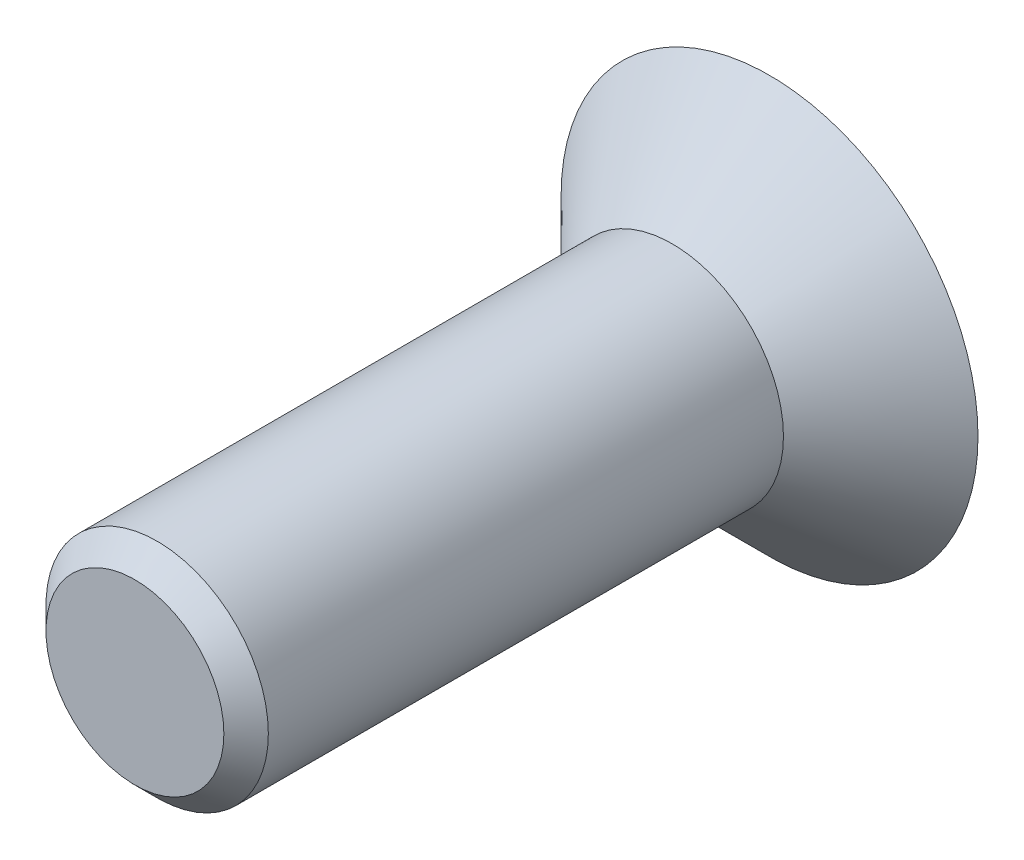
ISO-10303-21;
HEADER;
FILE_DESCRIPTION(('STEP AP214'),'2;1');
FILE_NAME('part.step','',(''),(''),'','','');
FILE_SCHEMA(('AUTOMOTIVE_DESIGN { 1 0 10303 214 1 1 1 1 }'));
ENDSEC;
DATA;
#1=APPLICATION_CONTEXT('core data for automotive mechanical design processes');
#2=APPLICATION_PROTOCOL_DEFINITION('international standard','automotive_design',2000,#1);
#3=PRODUCT_CONTEXT('',#1,'mechanical');
#4=PRODUCT('Part','Part','',(#3));
#5=PRODUCT_RELATED_PRODUCT_CATEGORY('part','',(#4));
#6=PRODUCT_DEFINITION_FORMATION('','',#4);
#7=PRODUCT_DEFINITION_CONTEXT('part definition',#1,'design');
#8=PRODUCT_DEFINITION('design','',#6,#7);
#9=PRODUCT_DEFINITION_SHAPE('','',#8);
#10=(LENGTH_UNIT() NAMED_UNIT(*) SI_UNIT(.MILLI.,.METRE.));
#11=(NAMED_UNIT(*) PLANE_ANGLE_UNIT() SI_UNIT($,.RADIAN.));
#12=(NAMED_UNIT(*) SI_UNIT($,.STERADIAN.) SOLID_ANGLE_UNIT());
#13=UNCERTAINTY_MEASURE_WITH_UNIT(LENGTH_MEASURE(1.E-05),#10,'distance_accuracy_value','');
#14=(GEOMETRIC_REPRESENTATION_CONTEXT(3) GLOBAL_UNCERTAINTY_ASSIGNED_CONTEXT((#13)) GLOBAL_UNIT_ASSIGNED_CONTEXT((#10,
#11,#12)) REPRESENTATION_CONTEXT('',''));
#15=CARTESIAN_POINT('',(0.,0.,0.));
#16=DIRECTION('',(0.,0.,1.));
#17=DIRECTION('',(1.,0.,0.));
#18=AXIS2_PLACEMENT_3D('',#15,#16,#17);
#19=CARTESIAN_POINT('',(0.,0.,-5.24999999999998));
#20=DIRECTION('',(0.,0.,1.));
#21=DIRECTION('',(1.,0.,0.));
#22=AXIS2_PLACEMENT_3D('',#19,#20,#21);
#23=PLANE('',#22);
#24=CARTESIAN_POINT('',(0.,0.,-5.24999999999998));
#25=DIRECTION('',(0.,0.,-1.));
#26=DIRECTION('',(-1.,0.,0.));
#27=AXIS2_PLACEMENT_3D('',#24,#25,#26);
#28=CIRCLE('',#27,11.25);
#29=CARTESIAN_POINT('',(-11.25,0.,-5.24999999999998));
#30=VERTEX_POINT('',#29);
#31=EDGE_CURVE('E100',#30,#30,#28,.T.);
#32=ORIENTED_EDGE('',*,*,#31,.T.);
#33=EDGE_LOOP('',(#32));
#34=FACE_BOUND('',#33,.T.);
#35=DIRECTION('',(-0.86602540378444,0.499999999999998,0.));
#36=VECTOR('',#35,1.);
#37=CARTESIAN_POINT('',(0.,4.61880215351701,-5.24999999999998));
#38=LINE('',#37,#36);
#39=CARTESIAN_POINT('',(4.,2.30940107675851,-5.24999999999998));
#40=VERTEX_POINT('',#39);
#41=CARTESIAN_POINT('',(0.,4.61880215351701,-5.24999999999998));
#42=VERTEX_POINT('',#41);
#43=EDGE_CURVE('E46',#40,#42,#38,.T.);
#44=ORIENTED_EDGE('',*,*,#43,.T.);
#45=DIRECTION('',(-0.866025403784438,-0.500000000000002,0.));
#46=VECTOR('',#45,1.);
#47=CARTESIAN_POINT('',(-4.,2.30940107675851,-5.24999999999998));
#48=LINE('',#47,#46);
#49=CARTESIAN_POINT('',(-4.,2.30940107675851,-5.24999999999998));
#50=VERTEX_POINT('',#49);
#51=EDGE_CURVE('E86',#42,#50,#48,.T.);
#52=ORIENTED_EDGE('',*,*,#51,.T.);
#53=DIRECTION('',(0.,-1.,0.));
#54=VECTOR('',#53,1.);
#55=CARTESIAN_POINT('',(-4.,-2.30940107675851,-5.24999999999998));
#56=LINE('',#55,#54);
#57=CARTESIAN_POINT('',(-4.,-2.30940107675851,-5.24999999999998));
#58=VERTEX_POINT('',#57);
#59=EDGE_CURVE('E94',#50,#58,#56,.T.);
#60=ORIENTED_EDGE('',*,*,#59,.T.);
#61=DIRECTION('',(0.866025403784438,-0.500000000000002,0.));
#62=VECTOR('',#61,1.);
#63=CARTESIAN_POINT('',(-4.,-2.30940107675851,-5.24999999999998));
#64=LINE('',#63,#62);
#65=CARTESIAN_POINT('',(0.,-4.61880215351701,-5.24999999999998));
#66=VERTEX_POINT('',#65);
#67=EDGE_CURVE('E112',#58,#66,#64,.T.);
#68=ORIENTED_EDGE('',*,*,#67,.T.);
#69=DIRECTION('',(0.86602540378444,0.499999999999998,0.));
#70=VECTOR('',#69,1.);
#71=CARTESIAN_POINT('',(0.,-4.61880215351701,-5.24999999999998));
#72=LINE('',#71,#70);
#73=CARTESIAN_POINT('',(4.,-2.30940107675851,-5.24999999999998));
#74=VERTEX_POINT('',#73);
#75=EDGE_CURVE('E115',#66,#74,#72,.T.);
#76=ORIENTED_EDGE('',*,*,#75,.T.);
#77=DIRECTION('',(0.,1.,0.));
#78=VECTOR('',#77,1.);
#79=CARTESIAN_POINT('',(4.,-2.30940107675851,-5.24999999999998));
#80=LINE('',#79,#78);
#81=EDGE_CURVE('E105',#74,#40,#80,.T.);
#82=ORIENTED_EDGE('',*,*,#81,.T.);
#83=EDGE_LOOP('',(#44,#52,#60,#68,#76,#82));
#84=FACE_BOUND('',#83,.T.);
#85=ADVANCED_FACE('F32',(#34,#84),#23,.F.);
#86=CARTESIAN_POINT('',(0.,0.,0.));
#87=DIRECTION('',(0.,0.,-1.));
#88=DIRECTION('',(-1.,0.,0.));
#89=AXIS2_PLACEMENT_3D('',#86,#87,#88);
#90=CONICAL_SURFACE('',#89,6.,0.78539816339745);
#91=ORIENTED_EDGE('',*,*,#31,.F.);
#92=EDGE_LOOP('',(#91));
#93=FACE_BOUND('',#92,.T.);
#94=CARTESIAN_POINT('',(0.,0.,0.));
#95=DIRECTION('',(0.,0.,1.));
#96=DIRECTION('',(1.,0.,0.));
#97=AXIS2_PLACEMENT_3D('',#94,#95,#96);
#98=CIRCLE('',#97,6.);
#99=CARTESIAN_POINT('',(6.,0.,0.));
#100=VERTEX_POINT('',#99);
#101=EDGE_CURVE('E106',#100,#100,#98,.T.);
#102=ORIENTED_EDGE('',*,*,#101,.F.);
#103=EDGE_LOOP('',(#102));
#104=FACE_BOUND('',#103,.T.);
#105=ADVANCED_FACE('F155',(#93,#104),#90,.T.);
#106=CARTESIAN_POINT('',(0.,4.61880215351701,-0.24999999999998));
#107=DIRECTION('',(-0.499999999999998,-0.86602540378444,0.));
#108=DIRECTION('',(0.86602540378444,-0.499999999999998,0.));
#109=AXIS2_PLACEMENT_3D('',#106,#107,#108);
#110=PLANE('',#109);
#111=ORIENTED_EDGE('',*,*,#43,.F.);
#112=DIRECTION('',(0.,0.,-1.));
#113=VECTOR('',#112,1.);
#114=CARTESIAN_POINT('',(4.,2.30940107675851,-0.24999999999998));
#115=LINE('',#114,#113);
#116=CARTESIAN_POINT('',(4.,2.30940107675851,-0.24999999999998));
#117=VERTEX_POINT('',#116);
#118=EDGE_CURVE('E128',#117,#40,#115,.T.);
#119=ORIENTED_EDGE('',*,*,#118,.F.);
#120=DIRECTION('',(-0.86602540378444,0.499999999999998,0.));
#121=VECTOR('',#120,1.);
#122=CARTESIAN_POINT('',(0.,4.61880215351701,-0.24999999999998));
#123=LINE('',#122,#121);
#124=CARTESIAN_POINT('',(0.,4.61880215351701,-0.24999999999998));
#125=VERTEX_POINT('',#124);
#126=EDGE_CURVE('E99',#117,#125,#123,.T.);
#127=ORIENTED_EDGE('',*,*,#126,.T.);
#128=DIRECTION('',(0.,0.,-1.));
#129=VECTOR('',#128,1.);
#130=CARTESIAN_POINT('',(0.,4.61880215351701,-0.24999999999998));
#131=LINE('',#130,#129);
#132=EDGE_CURVE('E88',#125,#42,#131,.T.);
#133=ORIENTED_EDGE('',*,*,#132,.T.);
#134=EDGE_LOOP('',(#111,#119,#127,#133));
#135=FACE_BOUND('',#134,.T.);
#136=ADVANCED_FACE('F97',(#135),#110,.T.);
#137=CARTESIAN_POINT('',(-4.,2.30940107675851,-0.24999999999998));
#138=DIRECTION('',(0.500000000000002,-0.866025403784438,0.));
#139=DIRECTION('',(0.866025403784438,0.500000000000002,0.));
#140=AXIS2_PLACEMENT_3D('',#137,#138,#139);
#141=PLANE('',#140);
#142=ORIENTED_EDGE('',*,*,#51,.F.);
#143=ORIENTED_EDGE('',*,*,#132,.F.);
#144=DIRECTION('',(-0.866025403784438,-0.500000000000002,0.));
#145=VECTOR('',#144,1.);
#146=CARTESIAN_POINT('',(-4.,2.30940107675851,-0.24999999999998));
#147=LINE('',#146,#145);
#148=CARTESIAN_POINT('',(-4.,2.30940107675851,-0.24999999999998));
#149=VERTEX_POINT('',#148);
#150=EDGE_CURVE('E119',#125,#149,#147,.T.);
#151=ORIENTED_EDGE('',*,*,#150,.T.);
#152=DIRECTION('',(0.,0.,-1.));
#153=VECTOR('',#152,1.);
#154=CARTESIAN_POINT('',(-4.,2.30940107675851,-0.24999999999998));
#155=LINE('',#154,#153);
#156=EDGE_CURVE('E90',#149,#50,#155,.T.);
#157=ORIENTED_EDGE('',*,*,#156,.T.);
#158=EDGE_LOOP('',(#142,#143,#151,#157));
#159=FACE_BOUND('',#158,.T.);
#160=ADVANCED_FACE('F87',(#159),#141,.T.);
#161=CARTESIAN_POINT('',(-4.,-2.30940107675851,-0.24999999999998));
#162=DIRECTION('',(1.,0.,0.));
#163=DIRECTION('',(0.,0.,-1.));
#164=AXIS2_PLACEMENT_3D('',#161,#162,#163);
#165=PLANE('',#164);
#166=ORIENTED_EDGE('',*,*,#59,.F.);
#167=ORIENTED_EDGE('',*,*,#156,.F.);
#168=DIRECTION('',(0.,-1.,0.));
#169=VECTOR('',#168,1.);
#170=CARTESIAN_POINT('',(-4.,-2.30940107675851,-0.24999999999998));
#171=LINE('',#170,#169);
#172=CARTESIAN_POINT('',(-4.,-2.30940107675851,-0.24999999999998));
#173=VERTEX_POINT('',#172);
#174=EDGE_CURVE('E121',#149,#173,#171,.T.);
#175=ORIENTED_EDGE('',*,*,#174,.T.);
#176=DIRECTION('',(0.,0.,-1.));
#177=VECTOR('',#176,1.);
#178=CARTESIAN_POINT('',(-4.,-2.30940107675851,-0.24999999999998));
#179=LINE('',#178,#177);
#180=EDGE_CURVE('E134',#173,#58,#179,.T.);
#181=ORIENTED_EDGE('',*,*,#180,.T.);
#182=EDGE_LOOP('',(#166,#167,#175,#181));
#183=FACE_BOUND('',#182,.T.);
#184=ADVANCED_FACE('F172',(#183),#165,.T.);
#185=CARTESIAN_POINT('',(-4.,-2.30940107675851,-0.24999999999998));
#186=DIRECTION('',(0.500000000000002,0.866025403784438,0.));
#187=DIRECTION('',(-0.866025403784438,0.500000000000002,0.));
#188=AXIS2_PLACEMENT_3D('',#185,#186,#187);
#189=PLANE('',#188);
#190=ORIENTED_EDGE('',*,*,#67,.F.);
#191=ORIENTED_EDGE('',*,*,#180,.F.);
#192=DIRECTION('',(0.866025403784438,-0.500000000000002,0.));
#193=VECTOR('',#192,1.);
#194=CARTESIAN_POINT('',(-4.,-2.30940107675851,-0.24999999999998));
#195=LINE('',#194,#193);
#196=CARTESIAN_POINT('',(0.,-4.61880215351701,-0.24999999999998));
#197=VERTEX_POINT('',#196);
#198=EDGE_CURVE('E123',#173,#197,#195,.T.);
#199=ORIENTED_EDGE('',*,*,#198,.T.);
#200=DIRECTION('',(0.,0.,-1.));
#201=VECTOR('',#200,1.);
#202=CARTESIAN_POINT('',(0.,-4.61880215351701,-0.24999999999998));
#203=LINE('',#202,#201);
#204=EDGE_CURVE('E132',#197,#66,#203,.T.);
#205=ORIENTED_EDGE('',*,*,#204,.T.);
#206=EDGE_LOOP('',(#190,#191,#199,#205));
#207=FACE_BOUND('',#206,.T.);
#208=ADVANCED_FACE('F175',(#207),#189,.T.);
#209=CARTESIAN_POINT('',(0.,-4.61880215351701,-0.24999999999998));
#210=DIRECTION('',(-0.499999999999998,0.86602540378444,0.));
#211=DIRECTION('',(-0.86602540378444,-0.499999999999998,0.));
#212=AXIS2_PLACEMENT_3D('',#209,#210,#211);
#213=PLANE('',#212);
#214=ORIENTED_EDGE('',*,*,#75,.F.);
#215=ORIENTED_EDGE('',*,*,#204,.F.);
#216=DIRECTION('',(0.86602540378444,0.499999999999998,0.));
#217=VECTOR('',#216,1.);
#218=CARTESIAN_POINT('',(0.,-4.61880215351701,-0.24999999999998));
#219=LINE('',#218,#217);
#220=CARTESIAN_POINT('',(4.,-2.30940107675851,-0.24999999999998));
#221=VERTEX_POINT('',#220);
#222=EDGE_CURVE('E125',#197,#221,#219,.T.);
#223=ORIENTED_EDGE('',*,*,#222,.T.);
#224=DIRECTION('',(0.,0.,-1.));
#225=VECTOR('',#224,1.);
#226=CARTESIAN_POINT('',(4.,-2.30940107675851,-0.24999999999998));
#227=LINE('',#226,#225);
#228=EDGE_CURVE('E130',#221,#74,#227,.T.);
#229=ORIENTED_EDGE('',*,*,#228,.T.);
#230=EDGE_LOOP('',(#214,#215,#223,#229));
#231=FACE_BOUND('',#230,.T.);
#232=ADVANCED_FACE('F179',(#231),#213,.T.);
#233=CARTESIAN_POINT('',(4.,-2.30940107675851,-0.24999999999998));
#234=DIRECTION('',(-1.,0.,0.));
#235=DIRECTION('',(0.,0.,1.));
#236=AXIS2_PLACEMENT_3D('',#233,#234,#235);
#237=PLANE('',#236);
#238=ORIENTED_EDGE('',*,*,#81,.F.);
#239=ORIENTED_EDGE('',*,*,#228,.F.);
#240=DIRECTION('',(0.,1.,0.));
#241=VECTOR('',#240,1.);
#242=CARTESIAN_POINT('',(4.,-2.30940107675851,-0.24999999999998));
#243=LINE('',#242,#241);
#244=EDGE_CURVE('E53',#221,#117,#243,.T.);
#245=ORIENTED_EDGE('',*,*,#244,.T.);
#246=ORIENTED_EDGE('',*,*,#118,.T.);
#247=EDGE_LOOP('',(#238,#239,#245,#246));
#248=FACE_BOUND('',#247,.T.);
#249=ADVANCED_FACE('F183',(#248),#237,.T.);
#250=CARTESIAN_POINT('',(4.,2.30940107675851,-0.24999999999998));
#251=DIRECTION('',(0.,0.,1.));
#252=DIRECTION('',(1.,0.,0.));
#253=AXIS2_PLACEMENT_3D('',#250,#251,#252);
#254=PLANE('',#253);
#255=ORIENTED_EDGE('',*,*,#126,.F.);
#256=ORIENTED_EDGE('',*,*,#244,.F.);
#257=ORIENTED_EDGE('',*,*,#222,.F.);
#258=ORIENTED_EDGE('',*,*,#198,.F.);
#259=ORIENTED_EDGE('',*,*,#174,.F.);
#260=ORIENTED_EDGE('',*,*,#150,.F.);
#261=EDGE_LOOP('',(#255,#256,#257,#258,#259,#260));
#262=FACE_BOUND('',#261,.T.);
#263=ADVANCED_FACE('F187',(#262),#254,.F.);
#264=CARTESIAN_POINT('',(0.,0.,29.));
#265=DIRECTION('',(0.,0.,1.));
#266=DIRECTION('',(1.,0.,0.));
#267=AXIS2_PLACEMENT_3D('',#264,#265,#266);
#268=PLANE('',#267);
#269=CARTESIAN_POINT('',(0.,0.,29.));
#270=DIRECTION('',(0.,0.,1.));
#271=DIRECTION('',(1.,0.,0.));
#272=AXIS2_PLACEMENT_3D('',#269,#270,#271);
#273=CIRCLE('',#272,4.8);
#274=CARTESIAN_POINT('',(4.80000000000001,0.,29.));
#275=VERTEX_POINT('',#274);
#276=EDGE_CURVE('E39',#275,#275,#273,.T.);
#277=ORIENTED_EDGE('',*,*,#276,.T.);
#278=EDGE_LOOP('',(#277));
#279=FACE_BOUND('',#278,.T.);
#280=ADVANCED_FACE('F141',(#279),#268,.T.);
#281=CARTESIAN_POINT('',(0.,0.,0.));
#282=DIRECTION('',(0.,0.,1.));
#283=DIRECTION('',(1.,0.,0.));
#284=AXIS2_PLACEMENT_3D('',#281,#282,#283);
#285=CYLINDRICAL_SURFACE('',#284,6.);
#286=CARTESIAN_POINT('',(0.,0.,27.8));
#287=DIRECTION('',(0.,0.,1.));
#288=DIRECTION('',(1.,0.,0.));
#289=AXIS2_PLACEMENT_3D('',#286,#287,#288);
#290=CIRCLE('',#289,6.);
#291=CARTESIAN_POINT('',(6.,0.,27.8));
#292=VERTEX_POINT('',#291);
#293=EDGE_CURVE('E11',#292,#292,#290,.F.);
#294=ORIENTED_EDGE('',*,*,#293,.T.);
#295=EDGE_LOOP('',(#294));
#296=FACE_BOUND('',#295,.T.);
#297=ORIENTED_EDGE('',*,*,#101,.T.);
#298=EDGE_LOOP('',(#297));
#299=FACE_BOUND('',#298,.T.);
#300=ADVANCED_FACE('F145',(#296,#299),#285,.T.);
#301=CARTESIAN_POINT('',(0.,0.,29.));
#302=DIRECTION('',(0.,0.,-1.));
#303=DIRECTION('',(-1.,0.,0.));
#304=AXIS2_PLACEMENT_3D('',#301,#302,#303);
#305=CONICAL_SURFACE('',#304,4.8,0.785398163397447);
#306=ORIENTED_EDGE('',*,*,#293,.F.);
#307=EDGE_LOOP('',(#306));
#308=FACE_BOUND('',#307,.T.);
#309=ORIENTED_EDGE('',*,*,#276,.F.);
#310=EDGE_LOOP('',(#309));
#311=FACE_BOUND('',#310,.T.);
#312=ADVANCED_FACE('F143',(#308,#311),#305,.T.);
#313=CLOSED_SHELL('',(#85,#105,#136,#160,#184,#208,#232,#249,#263,#280,#300,#312));
#314=MANIFOLD_SOLID_BREP('B2',#313);
#315=ADVANCED_BREP_SHAPE_REPRESENTATION('',(#18,#314),#14);
#316=SHAPE_DEFINITION_REPRESENTATION(#9,#315);
ENDSEC;
END-ISO-10303-21;
